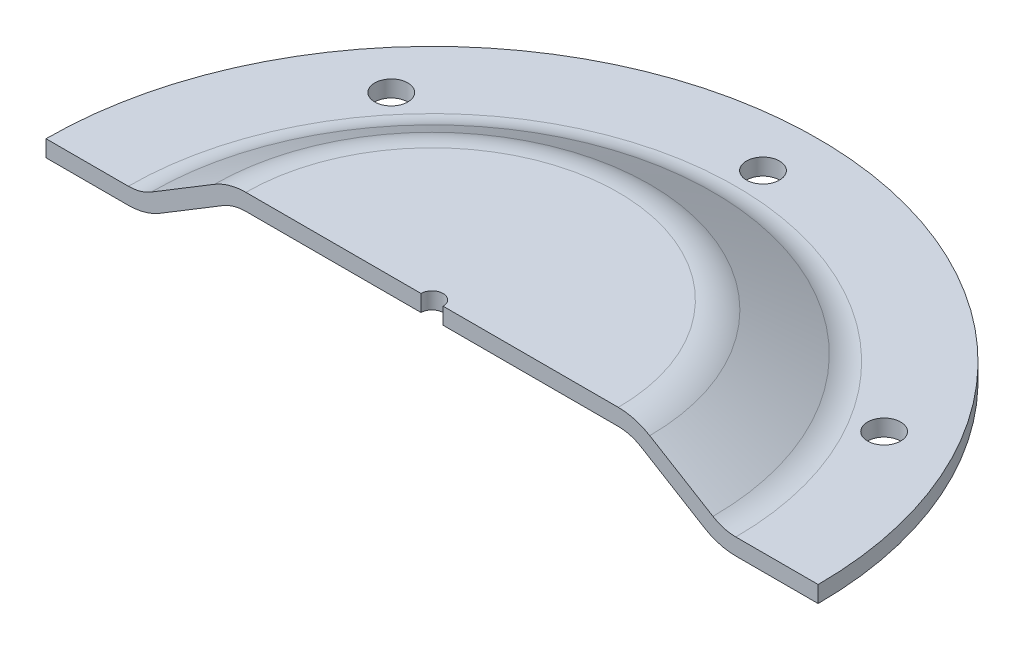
from build123d import *

# Parameters (mm, degrees)
ENL_V_MAT_EXTRU_2_REACH      = 72.998
ESQUISSE5_R                  = 1.5
R_P_TITION_CIRCULAIRE1_COUNT = 2
R_P_TITION_CIRCULAIRE1_ANGLE = 60
R_P_TITION_CIRCULAIRE2_COUNT = 2
R_P_TITION_CIRCULAIRE2_ANGLE = 50
SYM_TRIE2_COPY_1_REACH       = 72.998
SYM_TRIE2_COPY_1_SKETCH_R    = 1.5
SYM_TRIE2_COPY_2_REACH       = 72.998
SYM_TRIE2_COPY_2_SKETCH_R    = 1.5
ENL_V_MAT_EXTRU_3_REACH      = 51.903
ESQUISSE6_R                  = 1
ESQUISSE2_W                  = 35
ESQUISSE2_H                  = 6.35
COUPE_ANGLE                  = 180


with BuildPart() as part:
    # Esquisse1 → R_volution1 (revolve)
    with BuildSketch(Plane.XY, mode=Mode.PRIVATE) as r_volution1_sk:
        with BuildLine():
            Line((-35, -3.35), (-27.536990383, -3.35))
            ThreePointArc((-27.536990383, -3.35), (-26.460425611, -3.202402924), (-25.463309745, -2.770504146))
            Line((-25.463309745, -2.770504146), (-19.73349969, 0.7031932))
            ThreePointArc((-19.73349969, 0.7031932), (-18.362465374, 1.297054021), (-16.882188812, 1.5))
            Line((-16.882188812, 1.5), (0, 1.5))
            Line((0, 1.5), (0, 0))
            Line((0, 0), (-16.882188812, 0))
            ThreePointArc((-16.882188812, 0), (-17.958753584, -0.147597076), (-18.95586945, -0.579495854))
            Line((-18.95586945, -0.579495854), (-24.685679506, -4.0531932))
            ThreePointArc((-24.685679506, -4.0531932), (-26.056713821, -4.647054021), (-27.536990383, -4.85))
            Line((-27.536990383, -4.85), (-35, -4.85))
            Line((-35, -4.85), (-35, -3.35))
        make_face()
    revolve(r_volution1_sk.sketch.rotate(Axis((0, 1.5, 0), (0, 1, 0)), 270), axis=Axis((0, 1.5, 0), (0, 1, 0)))

    # Esquisse5 → Enl_v. mat.-Extru.2 (cut, up to next)
    with BuildSketch(Plane(origin=(-9.442910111, -3.35, -20.154109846), x_dir=(-1, 0, 0), z_dir=(0, 1, 0)), mode=Mode.PRIVATE) as enl_v_mat_extru_2_sk1:
        with Locations(Location((-9.442910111, -9.845890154, 0), (0, 0, 90))):
            Circle(ESQUISSE5_R)
    enl_v_mat_extru_2_tool1 = extrude(enl_v_mat_extru_2_sk1.sketch, amount=-ENL_V_MAT_EXTRU_2_REACH, mode=Mode.PRIVATE) & part.part
    enl_v_mat_extru_2 = enl_v_mat_extru_2_tool1.solids().sort_by_distance((0, -3.35, -30))[0]
    add(enl_v_mat_extru_2, mode=Mode.SUBTRACT)

    # R_p_tition circulaire1: Enl_v. mat.-Extru.2 ×2 about axis
    r_p_tition_circulaire1_axis = Axis((0, -3.35, 0), (0, -1, 0))
    for i in range(1, R_P_TITION_CIRCULAIRE1_COUNT):
        add(enl_v_mat_extru_2.rotate(r_p_tition_circulaire1_axis, i * R_P_TITION_CIRCULAIRE1_ANGLE / (R_P_TITION_CIRCULAIRE1_COUNT - 1)), mode=Mode.SUBTRACT)

    # R_p_tition circulaire2: Enl_v. mat.-Extru.2 ×2 about axis
    r_p_tition_circulaire2_axis = Axis((0, -3.35, 0), (0, 1, 0))
    for i in range(1, R_P_TITION_CIRCULAIRE2_COUNT):
        add(enl_v_mat_extru_2.rotate(r_p_tition_circulaire2_axis, i * R_P_TITION_CIRCULAIRE2_ANGLE / (R_P_TITION_CIRCULAIRE2_COUNT - 1)), mode=Mode.SUBTRACT)

    # Sym_trie2: Enl_v. mat.-Extru.2 across plane
    add(enl_v_mat_extru_2.mirror(Plane.XY), mode=Mode.SUBTRACT)

    # Sym_trie2 copy 1 sketch → Sym_trie2 copy 1 (cut, up to next)
    with BuildSketch(Plane(origin=(12.732516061, -3.35, 18.254854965), x_dir=(-0.49999999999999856, 0, 0.8660254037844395), z_dir=(0, 1, 0)), mode=Mode.PRIVATE) as sym_trie2_copy_1_sk1:
        with Locations((-9.442910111, 9.845890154)):
            Circle(SYM_TRIE2_COPY_1_SKETCH_R)
    sym_trie2_copy_1_tool1 = extrude(sym_trie2_copy_1_sk1.sketch, amount=-SYM_TRIE2_COPY_1_REACH, mode=Mode.PRIVATE) & part.part
    add(sym_trie2_copy_1_tool1.solids().sort_by_distance((25.980762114, -3.35, 15))[0], mode=Mode.SUBTRACT)

    # Sym_trie2 copy 2 sketch → Sym_trie2 copy 2 (cut, up to next)
    with BuildSketch(Plane(origin=(-21.508729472, -3.35, 5.721123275), x_dir=(-0.6427876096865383, 0, -0.7660444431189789), z_dir=(0, 1, 0)), mode=Mode.PRIVATE) as sym_trie2_copy_2_sk1:
        with Locations((-9.442910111, 9.845890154)):
            Circle(SYM_TRIE2_COPY_2_SKETCH_R)
    sym_trie2_copy_2_tool1 = extrude(sym_trie2_copy_2_sk1.sketch, amount=-SYM_TRIE2_COPY_2_REACH, mode=Mode.PRIVATE) & part.part
    add(sym_trie2_copy_2_tool1.solids().sort_by_distance((-22.981333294, -3.35, 19.283628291))[0], mode=Mode.SUBTRACT)

    # Esquisse6 → Enl_v. mat.-Extru.3 (cut, up to next)
    with BuildSketch(Plane(origin=(0, 1.5, 0), x_dir=(-1, 0, 0), z_dir=(0, 1, 0)), mode=Mode.PRIVATE) as enl_v_mat_extru_3_sk1:
        with Locations(Location((0, 0, 0), (0, 0, 90))):
            Circle(ESQUISSE6_R)
    enl_v_mat_extru_3_tool1 = extrude(enl_v_mat_extru_3_sk1.sketch, amount=-ENL_V_MAT_EXTRU_3_REACH, mode=Mode.PRIVATE) & part.part
    add(enl_v_mat_extru_3_tool1.solids().sort_by_distance((0, 1.5, 0))[0], mode=Mode.SUBTRACT)

    # Esquisse2 → Coupe (revolve, cut)
    with BuildSketch(Plane.XY):
        with Locations((17.5, -1.675)):
            Rectangle(ESQUISSE2_W, ESQUISSE2_H)
    revolve(axis=Axis((0, 1.5, 0), (0, -1, 0)), revolution_arc=COUPE_ANGLE, mode=Mode.SUBTRACT)


solid = part.part
